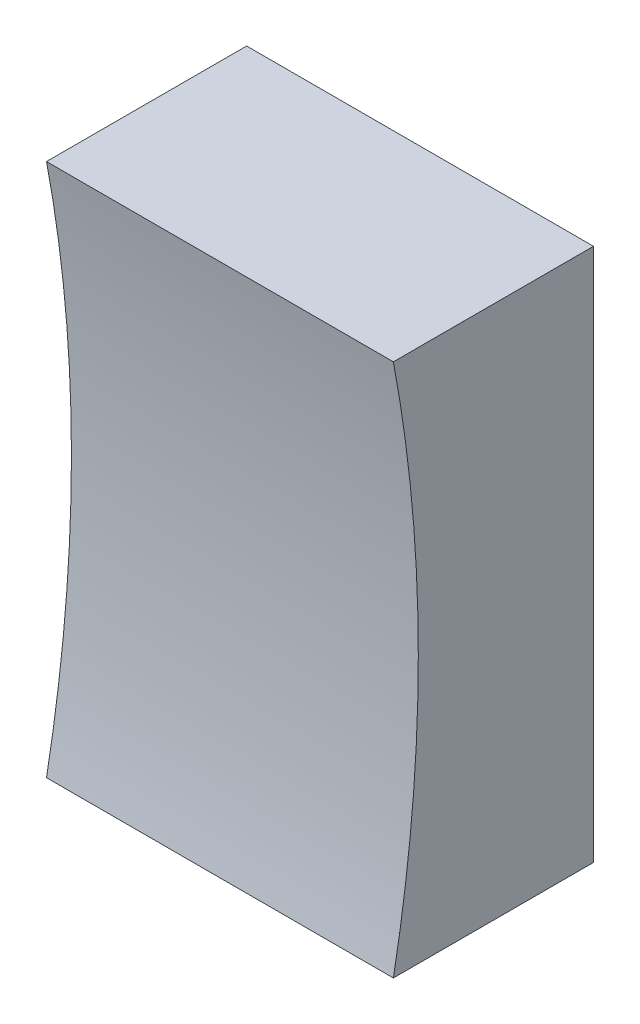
from build123d import *

# Parameters (mm, degrees)
SKETCH1_W          = 3.302
SKETCH1_H          = 5.08
EXTRUDE1_DEPTH     = 1.905
SKETCH2_R          = 13.716
CUT_EXTRUDE1_DEPTH = 5.580810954


with BuildPart() as part:
    # Sketch1 → Extrude1 (new body)
    with BuildSketch(Plane.XY):
        Rectangle(SKETCH1_W, SKETCH1_H)
    extrude(amount=EXTRUDE1_DEPTH)

    # Sketch2 → Cut-Extrude1 (cut, through all)
    with BuildSketch(Plane(origin=(1.651, 0, 0), x_dir=(0, 0, -1), z_dir=(1, 0, 0))):
        with Locations((-15.383763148, 0)):
            Circle(SKETCH2_R)
    extrude(amount=-CUT_EXTRUDE1_DEPTH, mode=Mode.SUBTRACT)


solid = part.part
